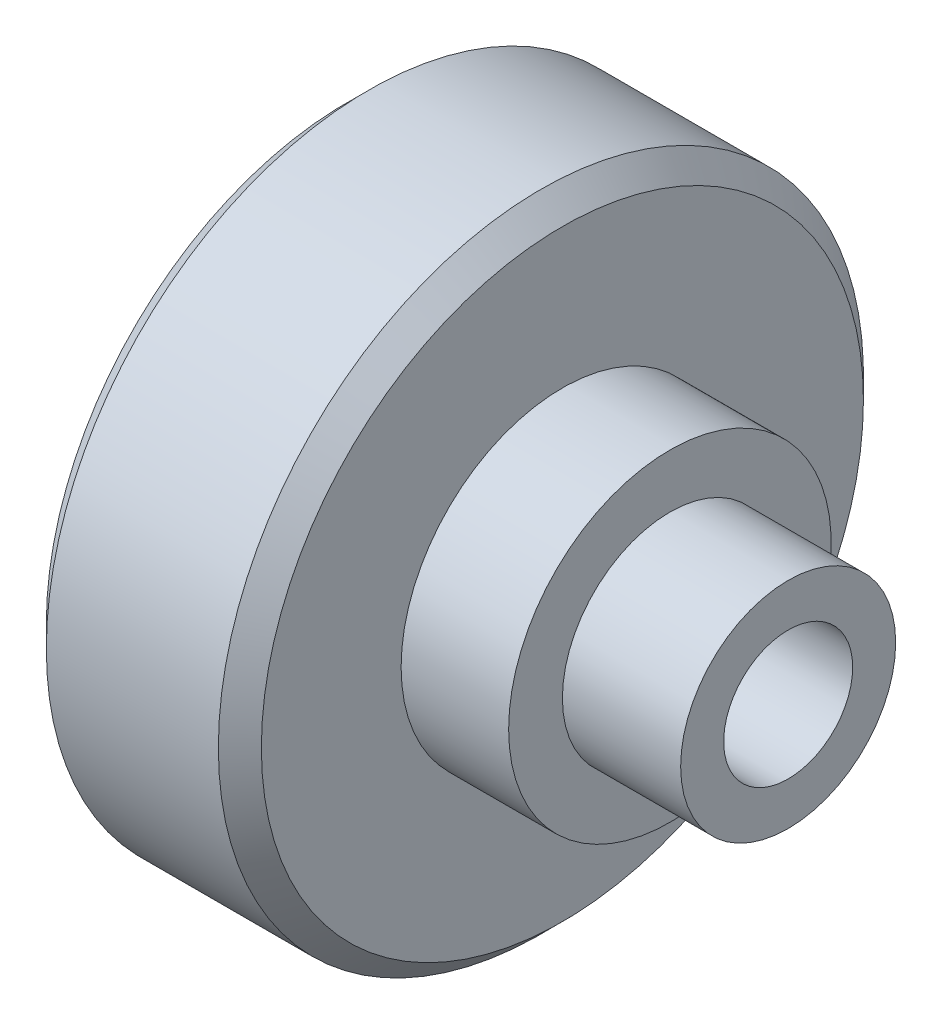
from build123d import *

# Parameters (mm, degrees)
SKETCH2_R          = 3
CUT_EXTRUDE1_DEPTH = 30.5
CHAMFER1_SIZE      = 1


with BuildPart() as part:
    # Sketch1 → Revolve1 (revolve)
    with BuildSketch(Plane(origin=(0, 0, 0), x_dir=(1, 0, 0), z_dir=(0, 1, 0)), mode=Mode.PRIVATE) as revolve1_sk:
        Polygon((0, 0), (20.5, 0), (20.5, 5), (15, 5), (15, 7.5), (10, 7.5), (10, 15), (0, 15), align=None)
    revolve(revolve1_sk.sketch.rotate(Axis((0, 0, 0), (1, 0, 0)), 180), axis=Axis((0, 0, 0), (1, 0, 0)))

    # Sketch2 → Cut-Extrude1 (cut, through all)
    with BuildSketch(Plane(origin=(20.5, 0, 0), x_dir=(0, 0, -1), z_dir=(1, 0, 0))):
        Circle(SKETCH2_R)
    extrude(amount=-CUT_EXTRUDE1_DEPTH, mode=Mode.SUBTRACT)

    # Chamfer1
    chamfer1_edges = [part.edges().sort_by_distance(p)[0] for p in [
        (0, 0, -15),
        (10, 0, -15),
    ]]
    chamfer(chamfer1_edges, length=CHAMFER1_SIZE)


solid = part.part
